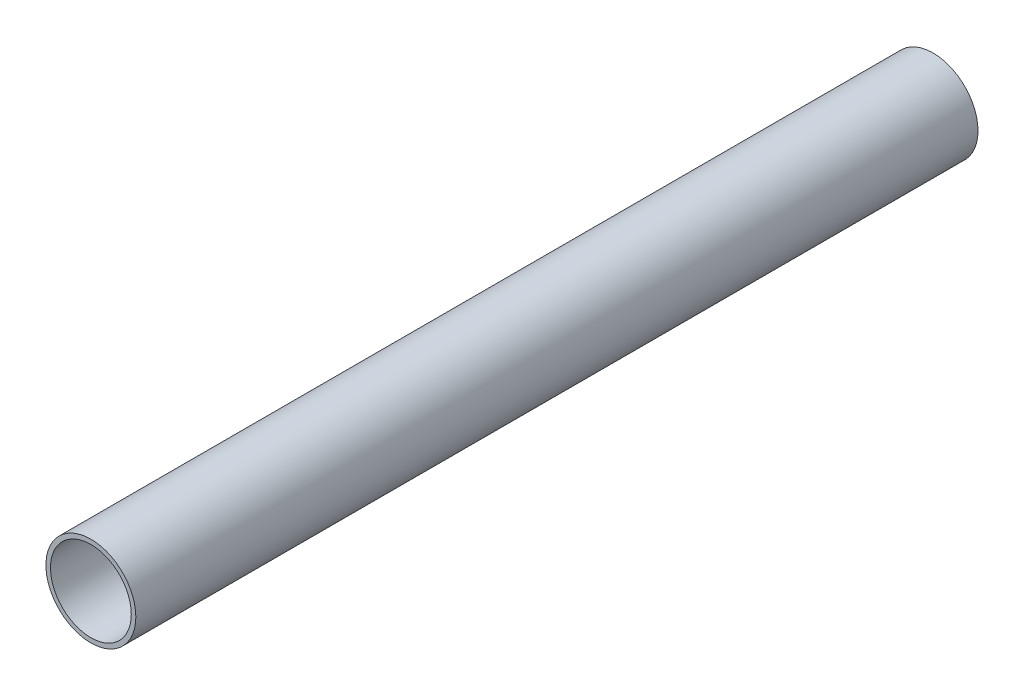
ISO-10303-21;
HEADER;
FILE_DESCRIPTION(('STEP AP214'),'2;1');
FILE_NAME('part.step','',(''),(''),'','','');
FILE_SCHEMA(('AUTOMOTIVE_DESIGN { 1 0 10303 214 1 1 1 1 }'));
ENDSEC;
DATA;
#1=APPLICATION_CONTEXT('core data for automotive mechanical design processes');
#2=APPLICATION_PROTOCOL_DEFINITION('international standard','automotive_design',2000,#1);
#3=PRODUCT_CONTEXT('',#1,'mechanical');
#4=PRODUCT('Part','Part','',(#3));
#5=PRODUCT_RELATED_PRODUCT_CATEGORY('part','',(#4));
#6=PRODUCT_DEFINITION_FORMATION('','',#4);
#7=PRODUCT_DEFINITION_CONTEXT('part definition',#1,'design');
#8=PRODUCT_DEFINITION('design','',#6,#7);
#9=PRODUCT_DEFINITION_SHAPE('','',#8);
#10=(LENGTH_UNIT() NAMED_UNIT(*) SI_UNIT(.MILLI.,.METRE.));
#11=(NAMED_UNIT(*) PLANE_ANGLE_UNIT() SI_UNIT($,.RADIAN.));
#12=(NAMED_UNIT(*) SI_UNIT($,.STERADIAN.) SOLID_ANGLE_UNIT());
#13=UNCERTAINTY_MEASURE_WITH_UNIT(LENGTH_MEASURE(1.E-05),#10,'distance_accuracy_value','');
#14=(GEOMETRIC_REPRESENTATION_CONTEXT(3) GLOBAL_UNCERTAINTY_ASSIGNED_CONTEXT((#13)) GLOBAL_UNIT_ASSIGNED_CONTEXT((#10,
#11,#12)) REPRESENTATION_CONTEXT('',''));
#15=CARTESIAN_POINT('',(0.,0.,0.));
#16=DIRECTION('',(0.,0.,1.));
#17=DIRECTION('',(1.,0.,0.));
#18=AXIS2_PLACEMENT_3D('',#15,#16,#17);
#19=CARTESIAN_POINT('',(-54.4028395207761,21.6262815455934,93.98));
#20=DIRECTION('',(0.,0.,1.));
#21=DIRECTION('',(1.,0.,0.));
#22=AXIS2_PLACEMENT_3D('',#19,#20,#21);
#23=PLANE('',#22);
#24=CARTESIAN_POINT('',(-54.4028395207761,21.6262815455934,93.98));
#25=DIRECTION('',(0.,0.,1.));
#26=DIRECTION('',(1.,0.,0.));
#27=AXIS2_PLACEMENT_3D('',#24,#25,#26);
#28=CIRCLE('',#27,5.0165);
#29=CARTESIAN_POINT('',(-49.3863395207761,21.6262815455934,93.98));
#30=VERTEX_POINT('',#29);
#31=EDGE_CURVE('E10',#30,#30,#28,.T.);
#32=ORIENTED_EDGE('',*,*,#31,.T.);
#33=EDGE_LOOP('',(#32));
#34=FACE_BOUND('',#33,.T.);
#35=CARTESIAN_POINT('',(-54.4028395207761,21.6262815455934,93.98));
#36=DIRECTION('',(0.,0.,1.));
#37=DIRECTION('',(1.,0.,0.));
#38=AXIS2_PLACEMENT_3D('',#35,#36,#37);
#39=CIRCLE('',#38,4.5085);
#40=CARTESIAN_POINT('',(-49.8943395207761,21.6262815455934,93.98));
#41=VERTEX_POINT('',#40);
#42=EDGE_CURVE('E44',#41,#41,#39,.T.);
#43=ORIENTED_EDGE('',*,*,#42,.F.);
#44=EDGE_LOOP('',(#43));
#45=FACE_BOUND('',#44,.T.);
#46=ADVANCED_FACE('F33',(#34,#45),#23,.T.);
#47=CARTESIAN_POINT('',(-54.4028395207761,21.6262815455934,0.));
#48=DIRECTION('',(0.,0.,1.));
#49=DIRECTION('',(1.,0.,0.));
#50=AXIS2_PLACEMENT_3D('',#47,#48,#49);
#51=PLANE('',#50);
#52=CARTESIAN_POINT('',(-54.4028395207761,21.6262815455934,0.));
#53=DIRECTION('',(0.,0.,1.));
#54=DIRECTION('',(1.,0.,0.));
#55=AXIS2_PLACEMENT_3D('',#52,#53,#54);
#56=CIRCLE('',#55,5.0165);
#57=CARTESIAN_POINT('',(-49.3863395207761,21.6262815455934,0.));
#58=VERTEX_POINT('',#57);
#59=EDGE_CURVE('E37',#58,#58,#56,.T.);
#60=ORIENTED_EDGE('',*,*,#59,.F.);
#61=EDGE_LOOP('',(#60));
#62=FACE_BOUND('',#61,.T.);
#63=CARTESIAN_POINT('',(-54.4028395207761,21.6262815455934,0.));
#64=DIRECTION('',(0.,0.,1.));
#65=DIRECTION('',(1.,0.,0.));
#66=AXIS2_PLACEMENT_3D('',#63,#64,#65);
#67=CIRCLE('',#66,4.5085);
#68=CARTESIAN_POINT('',(-49.8943395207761,21.6262815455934,0.));
#69=VERTEX_POINT('',#68);
#70=EDGE_CURVE('E46',#69,#69,#67,.T.);
#71=ORIENTED_EDGE('',*,*,#70,.T.);
#72=EDGE_LOOP('',(#71));
#73=FACE_BOUND('',#72,.T.);
#74=ADVANCED_FACE('F56',(#62,#73),#51,.F.);
#75=CARTESIAN_POINT('',(-54.4028395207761,21.6262815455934,93.98));
#76=DIRECTION('',(0.,0.,-1.));
#77=DIRECTION('',(-1.,0.,0.));
#78=AXIS2_PLACEMENT_3D('',#75,#76,#77);
#79=CYLINDRICAL_SURFACE('',#78,5.0165);
#80=ORIENTED_EDGE('',*,*,#31,.F.);
#81=EDGE_LOOP('',(#80));
#82=FACE_BOUND('',#81,.T.);
#83=ORIENTED_EDGE('',*,*,#59,.T.);
#84=EDGE_LOOP('',(#83));
#85=FACE_BOUND('',#84,.T.);
#86=ADVANCED_FACE('F35',(#82,#85),#79,.T.);
#87=CARTESIAN_POINT('',(-54.4028395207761,21.6262815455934,93.98));
#88=DIRECTION('',(0.,0.,-1.));
#89=DIRECTION('',(-1.,0.,0.));
#90=AXIS2_PLACEMENT_3D('',#87,#88,#89);
#91=CYLINDRICAL_SURFACE('',#90,4.5085);
#92=ORIENTED_EDGE('',*,*,#42,.T.);
#93=EDGE_LOOP('',(#92));
#94=FACE_BOUND('',#93,.T.);
#95=ORIENTED_EDGE('',*,*,#70,.F.);
#96=EDGE_LOOP('',(#95));
#97=FACE_BOUND('',#96,.T.);
#98=ADVANCED_FACE('F52',(#94,#97),#91,.F.);
#99=CLOSED_SHELL('',(#46,#74,#86,#98));
#100=MANIFOLD_SOLID_BREP('B2',#99);
#101=ADVANCED_BREP_SHAPE_REPRESENTATION('',(#18,#100),#14);
#102=SHAPE_DEFINITION_REPRESENTATION(#9,#101);
ENDSEC;
END-ISO-10303-21;
